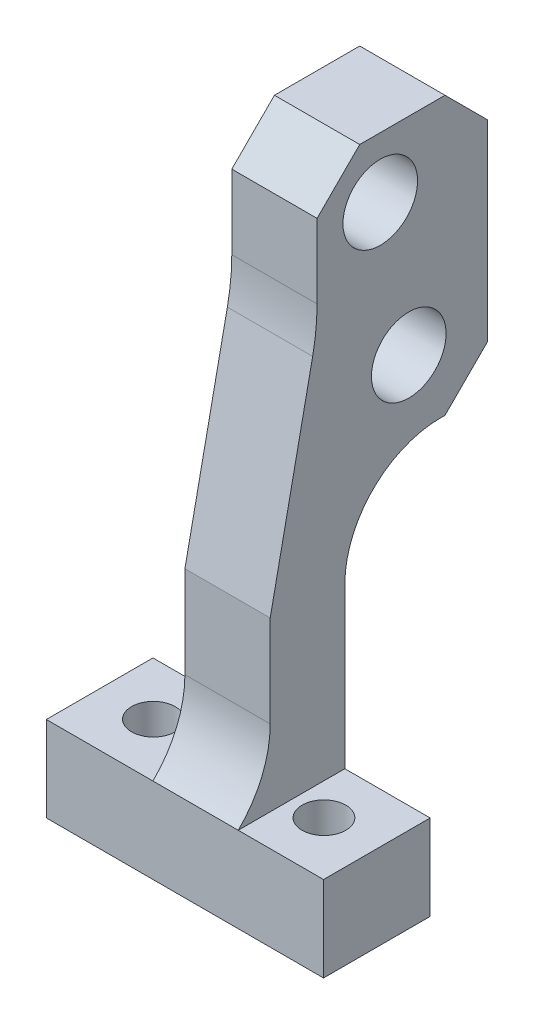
ISO-10303-21;
HEADER;
FILE_DESCRIPTION(('STEP AP214'),'2;1');
FILE_NAME('part.step','',(''),(''),'','','');
FILE_SCHEMA(('AUTOMOTIVE_DESIGN { 1 0 10303 214 1 1 1 1 }'));
ENDSEC;
DATA;
#1=APPLICATION_CONTEXT('core data for automotive mechanical design processes');
#2=APPLICATION_PROTOCOL_DEFINITION('international standard','automotive_design',2000,#1);
#3=PRODUCT_CONTEXT('',#1,'mechanical');
#4=PRODUCT('Part','Part','',(#3));
#5=PRODUCT_RELATED_PRODUCT_CATEGORY('part','',(#4));
#6=PRODUCT_DEFINITION_FORMATION('','',#4);
#7=PRODUCT_DEFINITION_CONTEXT('part definition',#1,'design');
#8=PRODUCT_DEFINITION('design','',#6,#7);
#9=PRODUCT_DEFINITION_SHAPE('','',#8);
#10=(LENGTH_UNIT() NAMED_UNIT(*) SI_UNIT(.MILLI.,.METRE.));
#11=(NAMED_UNIT(*) PLANE_ANGLE_UNIT() SI_UNIT($,.RADIAN.));
#12=(NAMED_UNIT(*) SI_UNIT($,.STERADIAN.) SOLID_ANGLE_UNIT());
#13=UNCERTAINTY_MEASURE_WITH_UNIT(LENGTH_MEASURE(1.E-05),#10,'distance_accuracy_value','');
#14=(GEOMETRIC_REPRESENTATION_CONTEXT(3) GLOBAL_UNCERTAINTY_ASSIGNED_CONTEXT((#13)) GLOBAL_UNIT_ASSIGNED_CONTEXT((#10,
#11,#12)) REPRESENTATION_CONTEXT('',''));
#15=CARTESIAN_POINT('',(0.,0.,0.));
#16=DIRECTION('',(0.,0.,1.));
#17=DIRECTION('',(1.,0.,0.));
#18=AXIS2_PLACEMENT_3D('',#15,#16,#17);
#19=CARTESIAN_POINT('',(0.,-15.3175903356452,7.70422161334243));
#20=DIRECTION('',(0.,-1.,0.));
#21=DIRECTION('',(0.,0.,-1.));
#22=AXIS2_PLACEMENT_3D('',#19,#20,#21);
#23=PLANE('',#22);
#24=CARTESIAN_POINT('',(5.5,-15.3175903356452,5.47422161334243));
#25=DIRECTION('',(0.,-1.,0.));
#26=DIRECTION('',(0.,0.,-1.));
#27=AXIS2_PLACEMENT_3D('',#24,#25,#26);
#28=CIRCLE('',#27,1.02499999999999);
#29=CARTESIAN_POINT('',(5.5,-15.3175903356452,4.44922161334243));
#30=VERTEX_POINT('',#29);
#31=EDGE_CURVE('E215',#30,#30,#28,.T.);
#32=ORIENTED_EDGE('',*,*,#31,.T.);
#33=EDGE_LOOP('',(#32));
#34=FACE_BOUND('',#33,.T.);
#35=DIRECTION('',(0.,0.,-1.));
#36=VECTOR('',#35,1.);
#37=CARTESIAN_POINT('',(4.,-15.3175903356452,7.70422161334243));
#38=LINE('',#37,#36);
#39=CARTESIAN_POINT('',(4.,-15.3175903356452,7.99352803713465));
#40=VERTEX_POINT('',#39);
#41=CARTESIAN_POINT('',(4.,-15.3175903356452,2.99352803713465));
#42=VERTEX_POINT('',#41);
#43=EDGE_CURVE('E62',#40,#42,#38,.T.);
#44=ORIENTED_EDGE('',*,*,#43,.F.);
#45=DIRECTION('',(-1.,0.,0.));
#46=VECTOR('',#45,1.);
#47=CARTESIAN_POINT('',(-5.,-15.3175903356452,7.99352803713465));
#48=LINE('',#47,#46);
#49=CARTESIAN_POINT('',(8.,-15.3175903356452,7.99352803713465));
#50=VERTEX_POINT('',#49);
#51=EDGE_CURVE('E389',#50,#40,#48,.T.);
#52=ORIENTED_EDGE('',*,*,#51,.F.);
#53=DIRECTION('',(0.,0.,1.));
#54=VECTOR('',#53,1.);
#55=CARTESIAN_POINT('',(8.,-15.3175903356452,7.70422161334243));
#56=LINE('',#55,#54);
#57=CARTESIAN_POINT('',(8.,-15.3175903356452,2.99352803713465));
#58=VERTEX_POINT('',#57);
#59=EDGE_CURVE('E196',#58,#50,#56,.T.);
#60=ORIENTED_EDGE('',*,*,#59,.F.);
#61=DIRECTION('',(1.,0.,0.));
#62=VECTOR('',#61,1.);
#63=CARTESIAN_POINT('',(0.,-15.3175903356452,2.99352803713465));
#64=LINE('',#63,#62);
#65=EDGE_CURVE('E177',#42,#58,#64,.T.);
#66=ORIENTED_EDGE('',*,*,#65,.F.);
#67=EDGE_LOOP('',(#44,#52,#60,#66));
#68=FACE_BOUND('',#67,.T.);
#69=ADVANCED_FACE('F40',(#34,#68),#23,.F.);
#70=CARTESIAN_POINT('',(-2.40614040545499,-15.3175903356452,6.49422161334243));
#71=CARTESIAN_POINT('',(-2.5,-15.3175903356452,6.50285263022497));
#72=CARTESIAN_POINT('',(-2.59385959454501,-15.3175903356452,6.49422161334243));
#73=B_SPLINE_CURVE_WITH_KNOTS('',2,(#70,#71,#72),.UNSPECIFIED.,.F.,.F.,(3,3),(0.,1.),.UNSPECIFIED.);
#74=CARTESIAN_POINT('',(-2.40614040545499,-15.3175903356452,6.49422161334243));
#75=VERTEX_POINT('',#74);
#76=CARTESIAN_POINT('',(-2.59385959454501,-15.3175903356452,6.49422161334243));
#77=VERTEX_POINT('',#76);
#78=EDGE_CURVE('E271',#75,#77,#73,.T.);
#79=ORIENTED_EDGE('',*,*,#78,.T.);
#80=CARTESIAN_POINT('',(-2.5,-15.3175903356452,5.47352803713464));
#81=DIRECTION('',(0.,-1.,0.));
#82=DIRECTION('',(0.,0.,-1.));
#83=AXIS2_PLACEMENT_3D('',#80,#81,#82);
#84=CIRCLE('',#83,1.02499999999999);
#85=EDGE_CURVE('E359',#77,#75,#84,.T.);
#86=ORIENTED_EDGE('',*,*,#85,.T.);
#87=EDGE_LOOP('',(#79,#86));
#88=FACE_BOUND('',#87,.T.);
#89=CARTESIAN_POINT('',(0.,-15.3175903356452,7.99352803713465));
#90=VERTEX_POINT('',#89);
#91=CARTESIAN_POINT('',(-5.,-15.3175903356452,7.99352803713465));
#92=VERTEX_POINT('',#91);
#93=EDGE_CURVE('E395',#90,#92,#48,.T.);
#94=ORIENTED_EDGE('',*,*,#93,.F.);
#95=DIRECTION('',(0.,0.,-1.));
#96=VECTOR('',#95,1.);
#97=CARTESIAN_POINT('',(0.,-15.3175903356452,7.70422161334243));
#98=LINE('',#97,#96);
#99=CARTESIAN_POINT('',(0.,-15.3175903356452,2.99352803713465));
#100=VERTEX_POINT('',#99);
#101=EDGE_CURVE('E54',#90,#100,#98,.T.);
#102=ORIENTED_EDGE('',*,*,#101,.T.);
#103=CARTESIAN_POINT('',(-5.,-15.3175903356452,2.99352803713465));
#104=VERTEX_POINT('',#103);
#105=EDGE_CURVE('E457',#104,#100,#64,.T.);
#106=ORIENTED_EDGE('',*,*,#105,.F.);
#107=DIRECTION('',(0.,0.,-1.));
#108=VECTOR('',#107,1.);
#109=CARTESIAN_POINT('',(-5.,-15.3175903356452,7.70422161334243));
#110=LINE('',#109,#108);
#111=EDGE_CURVE('E198',#92,#104,#110,.T.);
#112=ORIENTED_EDGE('',*,*,#111,.F.);
#113=EDGE_LOOP('',(#94,#102,#106,#112));
#114=FACE_BOUND('',#113,.T.);
#115=ADVANCED_FACE('F277',(#88,#114),#23,.F.);
#116=CARTESIAN_POINT('',(0.,-19.3175903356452,0.));
#117=DIRECTION('',(0.,-1.,0.));
#118=DIRECTION('',(0.,0.,-1.));
#119=AXIS2_PLACEMENT_3D('',#116,#117,#118);
#120=PLANE('',#119);
#121=CARTESIAN_POINT('',(5.5,-19.3175903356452,5.47422161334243));
#122=DIRECTION('',(0.,-1.,0.));
#123=DIRECTION('',(0.,0.,-1.));
#124=AXIS2_PLACEMENT_3D('',#121,#122,#123);
#125=CIRCLE('',#124,1.02499999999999);
#126=CARTESIAN_POINT('',(5.5,-19.3175903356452,4.44922161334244));
#127=VERTEX_POINT('',#126);
#128=EDGE_CURVE('E219',#127,#127,#125,.T.);
#129=ORIENTED_EDGE('',*,*,#128,.F.);
#130=EDGE_LOOP('',(#129));
#131=FACE_BOUND('',#130,.T.);
#132=CARTESIAN_POINT('',(-2.5,-19.3175903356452,5.47352803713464));
#133=DIRECTION('',(0.,-1.,0.));
#134=DIRECTION('',(0.,0.,-1.));
#135=AXIS2_PLACEMENT_3D('',#132,#133,#134);
#136=CIRCLE('',#135,1.02499999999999);
#137=CARTESIAN_POINT('',(-2.5,-19.3175903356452,4.44852803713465));
#138=VERTEX_POINT('',#137);
#139=EDGE_CURVE('E218',#138,#138,#136,.T.);
#140=ORIENTED_EDGE('',*,*,#139,.F.);
#141=EDGE_LOOP('',(#140));
#142=FACE_BOUND('',#141,.T.);
#143=DIRECTION('',(0.,0.,1.));
#144=VECTOR('',#143,1.);
#145=CARTESIAN_POINT('',(-5.,-19.3175903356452,7.70422161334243));
#146=LINE('',#145,#144);
#147=CARTESIAN_POINT('',(-5.,-19.3175903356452,2.99352803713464));
#148=VERTEX_POINT('',#147);
#149=CARTESIAN_POINT('',(-5.,-19.3175903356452,7.99352803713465));
#150=VERTEX_POINT('',#149);
#151=EDGE_CURVE('E190',#148,#150,#146,.T.);
#152=ORIENTED_EDGE('',*,*,#151,.F.);
#153=DIRECTION('',(1.,0.,0.));
#154=VECTOR('',#153,1.);
#155=CARTESIAN_POINT('',(0.,-19.3175903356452,2.99352803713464));
#156=LINE('',#155,#154);
#157=CARTESIAN_POINT('',(8.,-19.3175903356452,2.99352803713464));
#158=VERTEX_POINT('',#157);
#159=EDGE_CURVE('E175',#148,#158,#156,.T.);
#160=ORIENTED_EDGE('',*,*,#159,.T.);
#161=DIRECTION('',(0.,0.,-1.));
#162=VECTOR('',#161,1.);
#163=CARTESIAN_POINT('',(8.,-19.3175903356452,7.70422161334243));
#164=LINE('',#163,#162);
#165=CARTESIAN_POINT('',(8.,-19.3175903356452,7.99352803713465));
#166=VERTEX_POINT('',#165);
#167=EDGE_CURVE('E188',#166,#158,#164,.T.);
#168=ORIENTED_EDGE('',*,*,#167,.F.);
#169=DIRECTION('',(1.,0.,0.));
#170=VECTOR('',#169,1.);
#171=CARTESIAN_POINT('',(-5.,-19.3175903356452,7.99352803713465));
#172=LINE('',#171,#170);
#173=EDGE_CURVE('E463',#150,#166,#172,.T.);
#174=ORIENTED_EDGE('',*,*,#173,.F.);
#175=EDGE_LOOP('',(#152,#160,#168,#174));
#176=FACE_BOUND('',#175,.T.);
#177=ADVANCED_FACE('F186',(#131,#142,#176),#120,.T.);
#178=CARTESIAN_POINT('',(-5.,0.,0.));
#179=DIRECTION('',(1.,0.,0.));
#180=DIRECTION('',(0.,0.,-1.));
#181=AXIS2_PLACEMENT_3D('',#178,#179,#180);
#182=PLANE('',#181);
#183=DIRECTION('',(0.,1.,0.));
#184=VECTOR('',#183,1.);
#185=CARTESIAN_POINT('',(-5.,0.,2.99352803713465));
#186=LINE('',#185,#184);
#187=EDGE_CURVE('E455',#148,#104,#186,.T.);
#188=ORIENTED_EDGE('',*,*,#187,.F.);
#189=ORIENTED_EDGE('',*,*,#151,.T.);
#190=DIRECTION('',(0.,-1.,0.));
#191=VECTOR('',#190,1.);
#192=CARTESIAN_POINT('',(-5.,-15.3175903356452,7.99352803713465));
#193=LINE('',#192,#191);
#194=EDGE_CURVE('E462',#92,#150,#193,.T.);
#195=ORIENTED_EDGE('',*,*,#194,.F.);
#196=ORIENTED_EDGE('',*,*,#111,.T.);
#197=EDGE_LOOP('',(#188,#189,#195,#196));
#198=FACE_BOUND('',#197,.T.);
#199=ADVANCED_FACE('F287',(#198),#182,.F.);
#200=CARTESIAN_POINT('',(8.,0.,0.));
#201=DIRECTION('',(1.,0.,0.));
#202=DIRECTION('',(0.,0.,-1.));
#203=AXIS2_PLACEMENT_3D('',#200,#201,#202);
#204=PLANE('',#203);
#205=ORIENTED_EDGE('',*,*,#167,.T.);
#206=DIRECTION('',(0.,1.,0.));
#207=VECTOR('',#206,1.);
#208=CARTESIAN_POINT('',(8.,0.,2.99352803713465));
#209=LINE('',#208,#207);
#210=EDGE_CURVE('E171',#158,#58,#209,.T.);
#211=ORIENTED_EDGE('',*,*,#210,.T.);
#212=ORIENTED_EDGE('',*,*,#59,.T.);
#213=DIRECTION('',(0.,1.,0.));
#214=VECTOR('',#213,1.);
#215=CARTESIAN_POINT('',(8.,-15.3175903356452,7.99352803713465));
#216=LINE('',#215,#214);
#217=EDGE_CURVE('E195',#166,#50,#216,.T.);
#218=ORIENTED_EDGE('',*,*,#217,.F.);
#219=EDGE_LOOP('',(#205,#211,#212,#218));
#220=FACE_BOUND('',#219,.T.);
#221=ADVANCED_FACE('F193',(#220),#204,.T.);
#222=CARTESIAN_POINT('',(-7.,9.87139028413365,-3.70386834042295));
#223=DIRECTION('',(0.,0.,-1.));
#224=DIRECTION('',(0.,1.,0.));
#225=AXIS2_PLACEMENT_3D('',#222,#223,#224);
#226=PLANE('',#225);
#227=DIRECTION('',(0.,-1.,0.));
#228=VECTOR('',#227,1.);
#229=CARTESIAN_POINT('',(4.,-3.35301746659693,-3.70386834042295));
#230=LINE('',#229,#228);
#231=CARTESIAN_POINT('',(4.,7.68639028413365,-3.70386834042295));
#232=VERTEX_POINT('',#231);
#233=CARTESIAN_POINT('',(4.,-1.31301746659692,-3.70386834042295));
#234=VERTEX_POINT('',#233);
#235=EDGE_CURVE('E424',#232,#234,#230,.T.);
#236=ORIENTED_EDGE('',*,*,#235,.T.);
#237=DIRECTION('',(-1.,0.,0.));
#238=VECTOR('',#237,1.);
#239=CARTESIAN_POINT('',(-7.,-1.31301746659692,-3.70386834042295));
#240=LINE('',#239,#238);
#241=CARTESIAN_POINT('',(0.,-1.31301746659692,-3.70386834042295));
#242=VERTEX_POINT('',#241);
#243=EDGE_CURVE('E252',#234,#242,#240,.T.);
#244=ORIENTED_EDGE('',*,*,#243,.T.);
#245=DIRECTION('',(0.,-1.,0.));
#246=VECTOR('',#245,1.);
#247=CARTESIAN_POINT('',(0.,0.,-3.70386834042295));
#248=LINE('',#247,#246);
#249=CARTESIAN_POINT('',(0.,7.68639028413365,-3.70386834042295));
#250=VERTEX_POINT('',#249);
#251=EDGE_CURVE('E210',#250,#242,#248,.T.);
#252=ORIENTED_EDGE('',*,*,#251,.F.);
#253=DIRECTION('',(1.,0.,0.));
#254=VECTOR('',#253,1.);
#255=CARTESIAN_POINT('',(-7.,7.68639028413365,-3.70386834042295));
#256=LINE('',#255,#254);
#257=EDGE_CURVE('E249',#250,#232,#256,.T.);
#258=ORIENTED_EDGE('',*,*,#257,.T.);
#259=EDGE_LOOP('',(#236,#244,#252,#258));
#260=FACE_BOUND('',#259,.T.);
#261=ADVANCED_FACE('F292',(#260),#226,.T.);
#262=CARTESIAN_POINT('',(0.,0.,0.));
#263=DIRECTION('',(-1.,0.,0.));
#264=DIRECTION('',(0.,0.,1.));
#265=AXIS2_PLACEMENT_3D('',#262,#263,#264);
#266=PLANE('',#265);
#267=DIRECTION('',(0.,0.,-1.));
#268=VECTOR('',#267,1.);
#269=CARTESIAN_POINT('',(0.,-3.31301746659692,2.97352803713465));
#270=LINE('',#269,#268);
#271=CARTESIAN_POINT('',(0.,-3.31301746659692,-1.50647196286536));
#272=VERTEX_POINT('',#271);
#273=CARTESIAN_POINT('',(0.,-3.31301746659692,-1.70386834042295));
#274=VERTEX_POINT('',#273);
#275=EDGE_CURVE('E409',#272,#274,#270,.T.);
#276=ORIENTED_EDGE('',*,*,#275,.F.);
#277=CARTESIAN_POINT('',(0.,-7.81301746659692,-1.50647196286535));
#278=DIRECTION('',(-1.,0.,0.));
#279=DIRECTION('',(0.,0.,1.));
#280=AXIS2_PLACEMENT_3D('',#277,#278,#279);
#281=CIRCLE('',#280,4.5);
#282=CARTESIAN_POINT('',(0.,-7.81301746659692,2.99352803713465));
#283=VERTEX_POINT('',#282);
#284=EDGE_CURVE('E374',#272,#283,#281,.F.);
#285=ORIENTED_EDGE('',*,*,#284,.T.);
#286=DIRECTION('',(0.,-1.,0.));
#287=VECTOR('',#286,1.);
#288=CARTESIAN_POINT('',(0.,0.,2.99352803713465));
#289=LINE('',#288,#287);
#290=EDGE_CURVE('E453',#283,#100,#289,.T.);
#291=ORIENTED_EDGE('',*,*,#290,.T.);
#292=ORIENTED_EDGE('',*,*,#101,.F.);
#293=CARTESIAN_POINT('',(0.,-11.7475560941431,11.4942216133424));
#294=DIRECTION('',(-1.,0.,0.));
#295=DIRECTION('',(0.,0.,1.));
#296=AXIS2_PLACEMENT_3D('',#293,#294,#295);
#297=CIRCLE('',#296,5.);
#298=CARTESIAN_POINT('',(0.,-11.7475560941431,6.49422161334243));
#299=VERTEX_POINT('',#298);
#300=EDGE_CURVE('E13',#90,#299,#297,.F.);
#301=ORIENTED_EDGE('',*,*,#300,.T.);
#302=DIRECTION('',(0.,-1.,0.));
#303=VECTOR('',#302,1.);
#304=CARTESIAN_POINT('',(0.,-7.4432506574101,6.49422161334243));
#305=LINE('',#304,#303);
#306=CARTESIAN_POINT('',(0.,-7.4432506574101,6.49422161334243));
#307=VERTEX_POINT('',#306);
#308=EDGE_CURVE('E414',#307,#299,#305,.T.);
#309=ORIENTED_EDGE('',*,*,#308,.F.);
#310=DIRECTION('',(0.,0.979282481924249,-0.202498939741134));
#311=VECTOR('',#310,1.);
#312=CARTESIAN_POINT('',(0.,-7.4432506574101,6.49422161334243));
#313=LINE('',#312,#311);
#314=CARTESIAN_POINT('',(0.,2.1847896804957,4.50330684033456));
#315=VERTEX_POINT('',#314);
#316=EDGE_CURVE('E393',#307,#315,#313,.T.);
#317=ORIENTED_EDGE('',*,*,#316,.T.);
#318=CARTESIAN_POINT('',(0.,4.20977907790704,14.296131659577));
#319=DIRECTION('',(-1.,0.,0.));
#320=DIRECTION('',(0.,0.,1.));
#321=AXIS2_PLACEMENT_3D('',#318,#319,#320);
#322=CIRCLE('',#321,10.);
#323=CARTESIAN_POINT('',(0.,4.20977907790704,4.29613165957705));
#324=VERTEX_POINT('',#323);
#325=EDGE_CURVE('E236',#315,#324,#322,.F.);
#326=ORIENTED_EDGE('',*,*,#325,.T.);
#327=DIRECTION('',(0.,1.,0.));
#328=VECTOR('',#327,1.);
#329=CARTESIAN_POINT('',(0.,0.,4.29613165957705));
#330=LINE('',#329,#328);
#331=CARTESIAN_POINT('',(0.,7.68639028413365,4.29613165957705));
#332=VERTEX_POINT('',#331);
#333=EDGE_CURVE('E207',#324,#332,#330,.T.);
#334=ORIENTED_EDGE('',*,*,#333,.T.);
#335=DIRECTION('',(0.,-0.707106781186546,0.707106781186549));
#336=VECTOR('',#335,1.);
#337=CARTESIAN_POINT('',(0.,5.99126097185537,5.99126097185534));
#338=LINE('',#337,#336);
#339=CARTESIAN_POINT('',(0.,9.68639028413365,2.29613165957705));
#340=VERTEX_POINT('',#339);
#341=EDGE_CURVE('E254',#332,#340,#338,.F.);
#342=ORIENTED_EDGE('',*,*,#341,.T.);
#343=DIRECTION('',(0.,0.,-1.));
#344=VECTOR('',#343,1.);
#345=CARTESIAN_POINT('',(0.,9.68639028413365,0.));
#346=LINE('',#345,#344);
#347=CARTESIAN_POINT('',(0.,9.68639028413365,-1.70386834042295));
#348=VERTEX_POINT('',#347);
#349=EDGE_CURVE('E226',#340,#348,#346,.T.);
#350=ORIENTED_EDGE('',*,*,#349,.T.);
#351=DIRECTION('',(0.,0.707106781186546,0.707106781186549));
#352=VECTOR('',#351,1.);
#353=CARTESIAN_POINT('',(0.,5.69512931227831,-5.69512931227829));
#354=LINE('',#353,#352);
#355=EDGE_CURVE('E256',#348,#250,#354,.F.);
#356=ORIENTED_EDGE('',*,*,#355,.T.);
#357=ORIENTED_EDGE('',*,*,#251,.T.);
#358=DIRECTION('',(0.,0.707106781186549,-0.707106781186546));
#359=VECTOR('',#358,1.);
#360=CARTESIAN_POINT('',(0.,-2.50844290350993,-2.50844290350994));
#361=LINE('',#360,#359);
#362=EDGE_CURVE('E258',#242,#274,#361,.F.);
#363=ORIENTED_EDGE('',*,*,#362,.T.);
#364=EDGE_LOOP('',(#276,#285,#291,#292,#301,#309,#317,#326,#334,#342,#350,#356,#357,#363));
#365=FACE_BOUND('',#364,.T.);
#366=CARTESIAN_POINT('',(0.,6.85837281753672,1.33179462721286));
#367=DIRECTION('',(-1.,0.,0.));
#368=DIRECTION('',(0.,0.,1.));
#369=AXIS2_PLACEMENT_3D('',#366,#367,#368);
#370=CIRCLE('',#369,1.75);
#371=CARTESIAN_POINT('',(0.,6.85837281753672,3.08179462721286));
#372=VERTEX_POINT('',#371);
#373=EDGE_CURVE('E231',#372,#372,#370,.T.);
#374=ORIENTED_EDGE('',*,*,#373,.F.);
#375=EDGE_LOOP('',(#374));
#376=FACE_BOUND('',#375,.T.);
#377=CARTESIAN_POINT('',(0.,-0.0130174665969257,-0.00386834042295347));
#378=DIRECTION('',(-1.,0.,0.));
#379=DIRECTION('',(0.,0.,1.));
#380=AXIS2_PLACEMENT_3D('',#377,#378,#379);
#381=CIRCLE('',#380,1.75);
#382=CARTESIAN_POINT('',(0.,-0.0130174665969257,1.74613165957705));
#383=VERTEX_POINT('',#382);
#384=EDGE_CURVE('E227',#383,#383,#381,.T.);
#385=ORIENTED_EDGE('',*,*,#384,.F.);
#386=EDGE_LOOP('',(#385));
#387=FACE_BOUND('',#386,.T.);
#388=ADVANCED_FACE('F295',(#365,#376,#387),#266,.T.);
#389=CARTESIAN_POINT('',(-7.,2.37302117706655,4.29613165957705));
#390=DIRECTION('',(0.,0.,1.));
#391=DIRECTION('',(1.,0.,0.));
#392=AXIS2_PLACEMENT_3D('',#389,#390,#391);
#393=PLANE('',#392);
#394=DIRECTION('',(0.,1.,0.));
#395=VECTOR('',#394,1.);
#396=CARTESIAN_POINT('',(4.,9.87139028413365,4.29613165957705));
#397=LINE('',#396,#395);
#398=CARTESIAN_POINT('',(4.,4.20977907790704,4.29613165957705));
#399=VERTEX_POINT('',#398);
#400=CARTESIAN_POINT('',(4.,7.68639028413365,4.29613165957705));
#401=VERTEX_POINT('',#400);
#402=EDGE_CURVE('E200',#399,#401,#397,.T.);
#403=ORIENTED_EDGE('',*,*,#402,.T.);
#404=DIRECTION('',(-1.,0.,0.));
#405=VECTOR('',#404,1.);
#406=CARTESIAN_POINT('',(-7.,7.68639028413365,4.29613165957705));
#407=LINE('',#406,#405);
#408=EDGE_CURVE('E182',#401,#332,#407,.T.);
#409=ORIENTED_EDGE('',*,*,#408,.T.);
#410=ORIENTED_EDGE('',*,*,#333,.F.);
#411=DIRECTION('',(-1.,0.,0.));
#412=VECTOR('',#411,1.);
#413=CARTESIAN_POINT('',(4.,4.20977907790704,4.29613165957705));
#414=LINE('',#413,#412);
#415=EDGE_CURVE('E234',#324,#399,#414,.F.);
#416=ORIENTED_EDGE('',*,*,#415,.T.);
#417=EDGE_LOOP('',(#403,#409,#410,#416));
#418=FACE_BOUND('',#417,.T.);
#419=ADVANCED_FACE('F297',(#418),#393,.T.);
#420=CARTESIAN_POINT('',(4.,0.,0.));
#421=DIRECTION('',(-1.,0.,0.));
#422=DIRECTION('',(0.,0.,1.));
#423=AXIS2_PLACEMENT_3D('',#420,#421,#422);
#424=PLANE('',#423);
#425=DIRECTION('',(0.,-1.,0.));
#426=VECTOR('',#425,1.);
#427=CARTESIAN_POINT('',(4.,0.,2.99352803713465));
#428=LINE('',#427,#426);
#429=CARTESIAN_POINT('',(4.,-7.81301746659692,2.99352803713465));
#430=VERTEX_POINT('',#429);
#431=EDGE_CURVE('E451',#430,#42,#428,.T.);
#432=ORIENTED_EDGE('',*,*,#431,.F.);
#433=CARTESIAN_POINT('',(4.,-7.81301746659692,-1.50647196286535));
#434=DIRECTION('',(-1.,0.,0.));
#435=DIRECTION('',(0.,0.,1.));
#436=AXIS2_PLACEMENT_3D('',#433,#434,#435);
#437=CIRCLE('',#436,4.5);
#438=CARTESIAN_POINT('',(4.,-3.31301746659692,-1.50647196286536));
#439=VERTEX_POINT('',#438);
#440=EDGE_CURVE('E372',#430,#439,#437,.T.);
#441=ORIENTED_EDGE('',*,*,#440,.T.);
#442=DIRECTION('',(0.,0.,1.));
#443=VECTOR('',#442,1.);
#444=CARTESIAN_POINT('',(4.,-3.31301746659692,2.97352803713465));
#445=LINE('',#444,#443);
#446=CARTESIAN_POINT('',(4.,-3.31301746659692,-1.70386834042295));
#447=VERTEX_POINT('',#446);
#448=EDGE_CURVE('E411',#447,#439,#445,.T.);
#449=ORIENTED_EDGE('',*,*,#448,.F.);
#450=DIRECTION('',(0.,-0.707106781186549,0.707106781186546));
#451=VECTOR('',#450,1.);
#452=CARTESIAN_POINT('',(4.,-3.31301746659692,-1.70386834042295));
#453=LINE('',#452,#451);
#454=EDGE_CURVE('E247',#447,#234,#453,.F.);
#455=ORIENTED_EDGE('',*,*,#454,.T.);
#456=ORIENTED_EDGE('',*,*,#235,.F.);
#457=DIRECTION('',(0.,-0.707106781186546,-0.707106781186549));
#458=VECTOR('',#457,1.);
#459=CARTESIAN_POINT('',(4.,7.68639028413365,-3.70386834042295));
#460=LINE('',#459,#458);
#461=CARTESIAN_POINT('',(4.,9.68639028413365,-1.70386834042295));
#462=VERTEX_POINT('',#461);
#463=EDGE_CURVE('E245',#232,#462,#460,.F.);
#464=ORIENTED_EDGE('',*,*,#463,.T.);
#465=DIRECTION('',(0.,0.,-1.));
#466=VECTOR('',#465,1.);
#467=CARTESIAN_POINT('',(4.,9.68639028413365,0.));
#468=LINE('',#467,#466);
#469=CARTESIAN_POINT('',(4.,9.68639028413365,2.29613165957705));
#470=VERTEX_POINT('',#469);
#471=EDGE_CURVE('E209',#470,#462,#468,.T.);
#472=ORIENTED_EDGE('',*,*,#471,.F.);
#473=DIRECTION('',(0.,0.707106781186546,-0.707106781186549));
#474=VECTOR('',#473,1.);
#475=CARTESIAN_POINT('',(4.,7.68639028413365,4.29613165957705));
#476=LINE('',#475,#474);
#477=EDGE_CURVE('E243',#470,#401,#476,.F.);
#478=ORIENTED_EDGE('',*,*,#477,.T.);
#479=ORIENTED_EDGE('',*,*,#402,.F.);
#480=CARTESIAN_POINT('',(4.,4.20977907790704,14.296131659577));
#481=DIRECTION('',(-1.,0.,0.));
#482=DIRECTION('',(0.,0.,1.));
#483=AXIS2_PLACEMENT_3D('',#480,#481,#482);
#484=CIRCLE('',#483,10.);
#485=CARTESIAN_POINT('',(4.,2.1847896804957,4.50330684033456));
#486=VERTEX_POINT('',#485);
#487=EDGE_CURVE('E238',#399,#486,#484,.T.);
#488=ORIENTED_EDGE('',*,*,#487,.T.);
#489=DIRECTION('',(0.,-0.979282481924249,0.202498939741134));
#490=VECTOR('',#489,1.);
#491=CARTESIAN_POINT('',(4.,-7.4432506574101,6.49422161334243));
#492=LINE('',#491,#490);
#493=CARTESIAN_POINT('',(4.,-7.4432506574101,6.49422161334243));
#494=VERTEX_POINT('',#493);
#495=EDGE_CURVE('E399',#486,#494,#492,.T.);
#496=ORIENTED_EDGE('',*,*,#495,.T.);
#497=DIRECTION('',(0.,1.,0.));
#498=VECTOR('',#497,1.);
#499=CARTESIAN_POINT('',(4.,-7.4432506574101,6.49422161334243));
#500=LINE('',#499,#498);
#501=CARTESIAN_POINT('',(4.,-11.7475560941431,6.49422161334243));
#502=VERTEX_POINT('',#501);
#503=EDGE_CURVE('E384',#502,#494,#500,.T.);
#504=ORIENTED_EDGE('',*,*,#503,.F.);
#505=CARTESIAN_POINT('',(4.,-11.7475560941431,11.4942216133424));
#506=DIRECTION('',(-1.,0.,0.));
#507=DIRECTION('',(0.,0.,1.));
#508=AXIS2_PLACEMENT_3D('',#505,#506,#507);
#509=CIRCLE('',#508,5.);
#510=EDGE_CURVE('E48',#502,#40,#509,.T.);
#511=ORIENTED_EDGE('',*,*,#510,.T.);
#512=ORIENTED_EDGE('',*,*,#43,.T.);
#513=EDGE_LOOP('',(#432,#441,#449,#455,#456,#464,#472,#478,#479,#488,#496,#504,#511,#512));
#514=FACE_BOUND('',#513,.T.);
#515=CARTESIAN_POINT('',(4.,6.85837281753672,1.33179462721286));
#516=DIRECTION('',(-1.,0.,0.));
#517=DIRECTION('',(0.,0.,1.));
#518=AXIS2_PLACEMENT_3D('',#515,#516,#517);
#519=CIRCLE('',#518,1.75);
#520=CARTESIAN_POINT('',(4.,6.85837281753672,3.08179462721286));
#521=VERTEX_POINT('',#520);
#522=EDGE_CURVE('E228',#521,#521,#519,.T.);
#523=ORIENTED_EDGE('',*,*,#522,.T.);
#524=EDGE_LOOP('',(#523));
#525=FACE_BOUND('',#524,.T.);
#526=CARTESIAN_POINT('',(4.,-0.0130174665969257,-0.00386834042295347));
#527=DIRECTION('',(-1.,0.,0.));
#528=DIRECTION('',(0.,0.,1.));
#529=AXIS2_PLACEMENT_3D('',#526,#527,#528);
#530=CIRCLE('',#529,1.75);
#531=CARTESIAN_POINT('',(4.,-0.0130174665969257,1.74613165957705));
#532=VERTEX_POINT('',#531);
#533=EDGE_CURVE('E223',#532,#532,#530,.T.);
#534=ORIENTED_EDGE('',*,*,#533,.T.);
#535=EDGE_LOOP('',(#534));
#536=FACE_BOUND('',#535,.T.);
#537=ADVANCED_FACE('F300',(#514,#525,#536),#424,.F.);
#538=CARTESIAN_POINT('',(-2.5,-19.3175903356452,5.47352803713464));
#539=DIRECTION('',(0.,-1.,0.));
#540=DIRECTION('',(0.,0.,-1.));
#541=AXIS2_PLACEMENT_3D('',#538,#539,#540);
#542=CYLINDRICAL_SURFACE('',#541,1.02499999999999);
#543=ORIENTED_EDGE('',*,*,#139,.T.);
#544=EDGE_LOOP('',(#543));
#545=FACE_BOUND('',#544,.T.);
#546=ORIENTED_EDGE('',*,*,#78,.F.);
#547=ORIENTED_EDGE('',*,*,#85,.F.);
#548=EDGE_LOOP('',(#546,#547));
#549=FACE_BOUND('',#548,.T.);
#550=ADVANCED_FACE('F340',(#545,#549),#542,.F.);
#551=CARTESIAN_POINT('',(5.5,-19.3175903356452,5.47422161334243));
#552=DIRECTION('',(0.,-1.,0.));
#553=DIRECTION('',(0.,0.,-1.));
#554=AXIS2_PLACEMENT_3D('',#551,#552,#553);
#555=CYLINDRICAL_SURFACE('',#554,1.02499999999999);
#556=ORIENTED_EDGE('',*,*,#128,.T.);
#557=EDGE_LOOP('',(#556));
#558=FACE_BOUND('',#557,.T.);
#559=ORIENTED_EDGE('',*,*,#31,.F.);
#560=EDGE_LOOP('',(#559));
#561=FACE_BOUND('',#560,.T.);
#562=ADVANCED_FACE('F337',(#558,#561),#555,.F.);
#563=CARTESIAN_POINT('',(0.,0.,6.49422161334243));
#564=DIRECTION('',(0.,0.,1.));
#565=DIRECTION('',(1.,0.,0.));
#566=AXIS2_PLACEMENT_3D('',#563,#564,#565);
#567=PLANE('',#566);
#568=ORIENTED_EDGE('',*,*,#308,.T.);
#569=DIRECTION('',(1.,0.,0.));
#570=VECTOR('',#569,1.);
#571=CARTESIAN_POINT('',(4.,-11.7475560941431,6.49422161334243));
#572=LINE('',#571,#570);
#573=EDGE_CURVE('E376',#299,#502,#572,.T.);
#574=ORIENTED_EDGE('',*,*,#573,.T.);
#575=ORIENTED_EDGE('',*,*,#503,.T.);
#576=DIRECTION('',(-1.,0.,0.));
#577=VECTOR('',#576,1.);
#578=CARTESIAN_POINT('',(0.,-7.4432506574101,6.49422161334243));
#579=LINE('',#578,#577);
#580=EDGE_CURVE('E418',#494,#307,#579,.T.);
#581=ORIENTED_EDGE('',*,*,#580,.T.);
#582=EDGE_LOOP('',(#568,#574,#575,#581));
#583=FACE_BOUND('',#582,.T.);
#584=ADVANCED_FACE('F339',(#583),#567,.T.);
#585=CARTESIAN_POINT('',(0.,-3.31301746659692,0.));
#586=DIRECTION('',(0.,-1.,0.));
#587=DIRECTION('',(0.,0.,-1.));
#588=AXIS2_PLACEMENT_3D('',#585,#586,#587);
#589=PLANE('',#588);
#590=ORIENTED_EDGE('',*,*,#448,.T.);
#591=DIRECTION('',(1.,0.,0.));
#592=VECTOR('',#591,1.);
#593=CARTESIAN_POINT('',(0.,-3.31301746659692,-1.50647196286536));
#594=LINE('',#593,#592);
#595=EDGE_CURVE('E370',#439,#272,#594,.F.);
#596=ORIENTED_EDGE('',*,*,#595,.T.);
#597=ORIENTED_EDGE('',*,*,#275,.T.);
#598=DIRECTION('',(1.,0.,0.));
#599=VECTOR('',#598,1.);
#600=CARTESIAN_POINT('',(0.,-3.31301746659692,-1.70386834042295));
#601=LINE('',#600,#599);
#602=EDGE_CURVE('E240',#274,#447,#601,.T.);
#603=ORIENTED_EDGE('',*,*,#602,.T.);
#604=EDGE_LOOP('',(#590,#596,#597,#603));
#605=FACE_BOUND('',#604,.T.);
#606=ADVANCED_FACE('F347',(#605),#589,.T.);
#607=CARTESIAN_POINT('',(1.86264302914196,9.68639028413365,0.));
#608=DIRECTION('',(0.,1.,0.));
#609=DIRECTION('',(0.,0.,1.));
#610=AXIS2_PLACEMENT_3D('',#607,#608,#609);
#611=PLANE('',#610);
#612=ORIENTED_EDGE('',*,*,#471,.T.);
#613=DIRECTION('',(-1.,0.,0.));
#614=VECTOR('',#613,1.);
#615=CARTESIAN_POINT('',(1.86264302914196,9.68639028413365,-1.70386834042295));
#616=LINE('',#615,#614);
#617=EDGE_CURVE('E263',#462,#348,#616,.T.);
#618=ORIENTED_EDGE('',*,*,#617,.T.);
#619=ORIENTED_EDGE('',*,*,#349,.F.);
#620=DIRECTION('',(1.,0.,0.));
#621=VECTOR('',#620,1.);
#622=CARTESIAN_POINT('',(1.86264302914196,9.68639028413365,2.29613165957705));
#623=LINE('',#622,#621);
#624=EDGE_CURVE('E261',#340,#470,#623,.T.);
#625=ORIENTED_EDGE('',*,*,#624,.T.);
#626=EDGE_LOOP('',(#612,#618,#619,#625));
#627=FACE_BOUND('',#626,.T.);
#628=ADVANCED_FACE('F439',(#627),#611,.T.);
#629=CARTESIAN_POINT('',(8.,-0.0130174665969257,-0.00386834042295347));
#630=DIRECTION('',(-1.,0.,0.));
#631=DIRECTION('',(0.,0.,1.));
#632=AXIS2_PLACEMENT_3D('',#629,#630,#631);
#633=CYLINDRICAL_SURFACE('',#632,1.75);
#634=ORIENTED_EDGE('',*,*,#384,.T.);
#635=EDGE_LOOP('',(#634));
#636=FACE_BOUND('',#635,.T.);
#637=ORIENTED_EDGE('',*,*,#533,.F.);
#638=EDGE_LOOP('',(#637));
#639=FACE_BOUND('',#638,.T.);
#640=ADVANCED_FACE('F613',(#636,#639),#633,.F.);
#641=CARTESIAN_POINT('',(8.,6.85837281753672,1.33179462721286));
#642=DIRECTION('',(-1.,0.,0.));
#643=DIRECTION('',(0.,0.,1.));
#644=AXIS2_PLACEMENT_3D('',#641,#642,#643);
#645=CYLINDRICAL_SURFACE('',#644,1.75);
#646=ORIENTED_EDGE('',*,*,#373,.T.);
#647=EDGE_LOOP('',(#646));
#648=FACE_BOUND('',#647,.T.);
#649=ORIENTED_EDGE('',*,*,#522,.F.);
#650=EDGE_LOOP('',(#649));
#651=FACE_BOUND('',#650,.T.);
#652=ADVANCED_FACE('F589',(#648,#651),#645,.F.);
#653=CARTESIAN_POINT('',(14.8548220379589,-7.4432506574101,6.49422161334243));
#654=DIRECTION('',(0.,0.202498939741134,0.979282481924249));
#655=DIRECTION('',(0.,-0.979282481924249,0.202498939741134));
#656=AXIS2_PLACEMENT_3D('',#653,#654,#655);
#657=PLANE('',#656);
#658=ORIENTED_EDGE('',*,*,#495,.F.);
#659=DIRECTION('',(-1.,0.,0.));
#660=VECTOR('',#659,1.);
#661=CARTESIAN_POINT('',(0.,2.1847896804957,4.50330684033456));
#662=LINE('',#661,#660);
#663=EDGE_CURVE('E222',#486,#315,#662,.T.);
#664=ORIENTED_EDGE('',*,*,#663,.T.);
#665=ORIENTED_EDGE('',*,*,#316,.F.);
#666=ORIENTED_EDGE('',*,*,#580,.F.);
#667=EDGE_LOOP('',(#658,#664,#665,#666));
#668=FACE_BOUND('',#667,.T.);
#669=ADVANCED_FACE('F308',(#668),#657,.T.);
#670=CARTESIAN_POINT('',(14.8548220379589,4.20977907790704,14.296131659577));
#671=DIRECTION('',(1.,0.,0.));
#672=DIRECTION('',(0.,0.,-1.));
#673=AXIS2_PLACEMENT_3D('',#670,#671,#672);
#674=CYLINDRICAL_SURFACE('',#673,10.);
#675=ORIENTED_EDGE('',*,*,#487,.F.);
#676=ORIENTED_EDGE('',*,*,#415,.F.);
#677=ORIENTED_EDGE('',*,*,#325,.F.);
#678=ORIENTED_EDGE('',*,*,#663,.F.);
#679=EDGE_LOOP('',(#675,#676,#677,#678));
#680=FACE_BOUND('',#679,.T.);
#681=ADVANCED_FACE('F304',(#680),#674,.F.);
#682=CARTESIAN_POINT('',(0.,-3.31301746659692,-1.70386834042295));
#683=DIRECTION('',(0.,0.707106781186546,0.707106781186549));
#684=DIRECTION('',(1.,0.,0.));
#685=AXIS2_PLACEMENT_3D('',#682,#683,#684);
#686=PLANE('',#685);
#687=ORIENTED_EDGE('',*,*,#362,.F.);
#688=ORIENTED_EDGE('',*,*,#243,.F.);
#689=ORIENTED_EDGE('',*,*,#454,.F.);
#690=ORIENTED_EDGE('',*,*,#602,.F.);
#691=EDGE_LOOP('',(#687,#688,#689,#690));
#692=FACE_BOUND('',#691,.T.);
#693=ADVANCED_FACE('F307',(#692),#686,.F.);
#694=CARTESIAN_POINT('',(-7.,7.68639028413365,-3.70386834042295));
#695=DIRECTION('',(0.,-0.707106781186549,0.707106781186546));
#696=DIRECTION('',(1.,0.,0.));
#697=AXIS2_PLACEMENT_3D('',#694,#695,#696);
#698=PLANE('',#697);
#699=ORIENTED_EDGE('',*,*,#355,.F.);
#700=ORIENTED_EDGE('',*,*,#617,.F.);
#701=ORIENTED_EDGE('',*,*,#463,.F.);
#702=ORIENTED_EDGE('',*,*,#257,.F.);
#703=EDGE_LOOP('',(#699,#700,#701,#702));
#704=FACE_BOUND('',#703,.T.);
#705=ADVANCED_FACE('F312',(#704),#698,.F.);
#706=CARTESIAN_POINT('',(-7.,7.68639028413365,4.29613165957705));
#707=DIRECTION('',(0.,-0.707106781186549,-0.707106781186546));
#708=DIRECTION('',(-1.,0.,0.));
#709=AXIS2_PLACEMENT_3D('',#706,#707,#708);
#710=PLANE('',#709);
#711=ORIENTED_EDGE('',*,*,#477,.F.);
#712=ORIENTED_EDGE('',*,*,#624,.F.);
#713=ORIENTED_EDGE('',*,*,#341,.F.);
#714=ORIENTED_EDGE('',*,*,#408,.F.);
#715=EDGE_LOOP('',(#711,#712,#713,#714));
#716=FACE_BOUND('',#715,.T.);
#717=ADVANCED_FACE('F316',(#716),#710,.F.);
#718=CARTESIAN_POINT('',(0.,0.,7.99352803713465));
#719=DIRECTION('',(0.,0.,1.));
#720=DIRECTION('',(1.,0.,0.));
#721=AXIS2_PLACEMENT_3D('',#718,#719,#720);
#722=PLANE('',#721);
#723=ORIENTED_EDGE('',*,*,#194,.T.);
#724=ORIENTED_EDGE('',*,*,#173,.T.);
#725=ORIENTED_EDGE('',*,*,#217,.T.);
#726=ORIENTED_EDGE('',*,*,#51,.T.);
#727=EDGE_CURVE('E391',#40,#90,#48,.T.);
#728=ORIENTED_EDGE('',*,*,#727,.T.);
#729=ORIENTED_EDGE('',*,*,#93,.T.);
#730=EDGE_LOOP('',(#723,#724,#725,#726,#728,#729));
#731=FACE_BOUND('',#730,.T.);
#732=ADVANCED_FACE('F319',(#731),#722,.T.);
#733=CARTESIAN_POINT('',(0.,0.,2.99352803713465));
#734=DIRECTION('',(0.,0.,-1.));
#735=DIRECTION('',(0.,1.,0.));
#736=AXIS2_PLACEMENT_3D('',#733,#734,#735);
#737=PLANE('',#736);
#738=ORIENTED_EDGE('',*,*,#290,.F.);
#739=DIRECTION('',(1.,0.,0.));
#740=VECTOR('',#739,1.);
#741=CARTESIAN_POINT('',(4.,-7.81301746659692,2.99352803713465));
#742=LINE('',#741,#740);
#743=EDGE_CURVE('E181',#283,#430,#742,.T.);
#744=ORIENTED_EDGE('',*,*,#743,.T.);
#745=ORIENTED_EDGE('',*,*,#431,.T.);
#746=ORIENTED_EDGE('',*,*,#65,.T.);
#747=ORIENTED_EDGE('',*,*,#210,.F.);
#748=ORIENTED_EDGE('',*,*,#159,.F.);
#749=ORIENTED_EDGE('',*,*,#187,.T.);
#750=ORIENTED_EDGE('',*,*,#105,.T.);
#751=EDGE_LOOP('',(#738,#744,#745,#746,#747,#748,#749,#750));
#752=FACE_BOUND('',#751,.T.);
#753=ADVANCED_FACE('F174',(#752),#737,.T.);
#754=CARTESIAN_POINT('',(0.,-7.81301746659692,-1.50647196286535));
#755=DIRECTION('',(-1.,0.,0.));
#756=DIRECTION('',(0.,0.,1.));
#757=AXIS2_PLACEMENT_3D('',#754,#755,#756);
#758=CYLINDRICAL_SURFACE('',#757,4.5);
#759=ORIENTED_EDGE('',*,*,#284,.F.);
#760=ORIENTED_EDGE('',*,*,#595,.F.);
#761=ORIENTED_EDGE('',*,*,#440,.F.);
#762=ORIENTED_EDGE('',*,*,#743,.F.);
#763=EDGE_LOOP('',(#759,#760,#761,#762));
#764=FACE_BOUND('',#763,.T.);
#765=ADVANCED_FACE('F321',(#764),#758,.F.);
#766=CARTESIAN_POINT('',(0.,-11.7475560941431,11.4942216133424));
#767=DIRECTION('',(-1.,0.,0.));
#768=DIRECTION('',(0.,0.,1.));
#769=AXIS2_PLACEMENT_3D('',#766,#767,#768);
#770=CYLINDRICAL_SURFACE('',#769,5.);
#771=ORIENTED_EDGE('',*,*,#300,.F.);
#772=ORIENTED_EDGE('',*,*,#727,.F.);
#773=ORIENTED_EDGE('',*,*,#510,.F.);
#774=ORIENTED_EDGE('',*,*,#573,.F.);
#775=EDGE_LOOP('',(#771,#772,#773,#774));
#776=FACE_BOUND('',#775,.T.);
#777=ADVANCED_FACE('F42',(#776),#770,.F.);
#778=CLOSED_SHELL('',(#69,#115,#177,#199,#221,#261,#388,#419,#537,#550,#562,#584,#606,#628,#640,
#652,#669,#681,#693,#705,#717,#732,#753,#765,#777));
#779=MANIFOLD_SOLID_BREP('B2',#778);
#780=ADVANCED_BREP_SHAPE_REPRESENTATION('',(#18,#779),#14);
#781=SHAPE_DEFINITION_REPRESENTATION(#9,#780);
ENDSEC;
END-ISO-10303-21;
